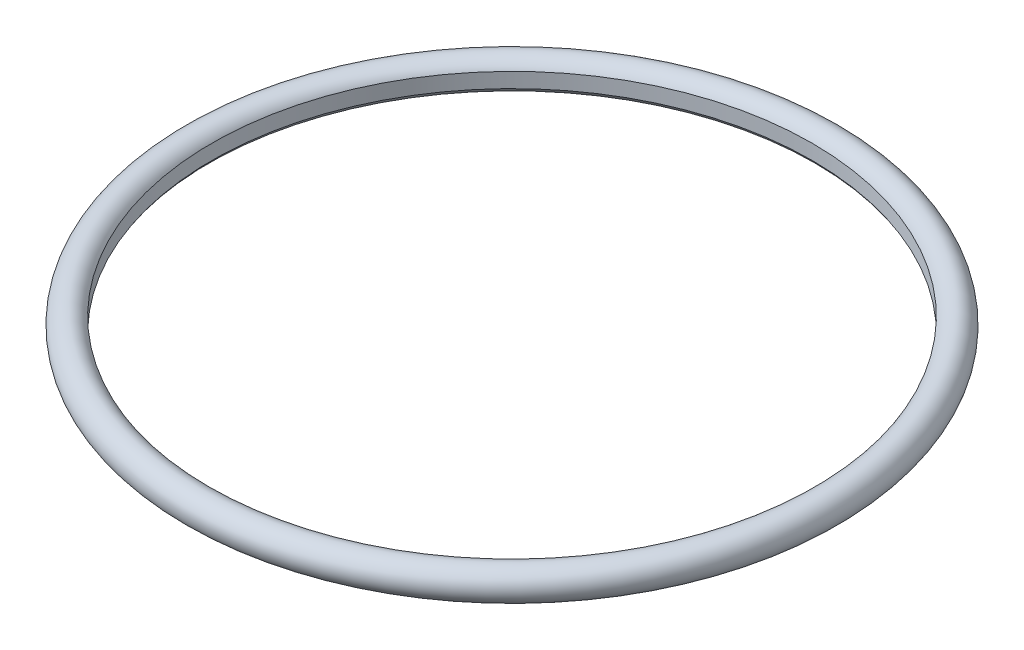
from build123d import *


with BuildPart() as part:
    # Schizzo1 → Rivoluzione1 (revolve)
    with BuildSketch(Plane.XY, mode=Mode.PRIVATE) as rivoluzione1_sk:
        with BuildLine():
            Line((23.9, 0.593717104), (23.9, -0.593717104))
            ThreePointArc((23.9, -0.593717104), (26.25, 0), (23.9, 0.593717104))
        make_face()
    revolve(rivoluzione1_sk.sketch.rotate(Axis((0, 0, 0), (0, 1, 0)), 90), axis=Axis((0, 0, 0), (0, 1, 0)))


solid = part.part
